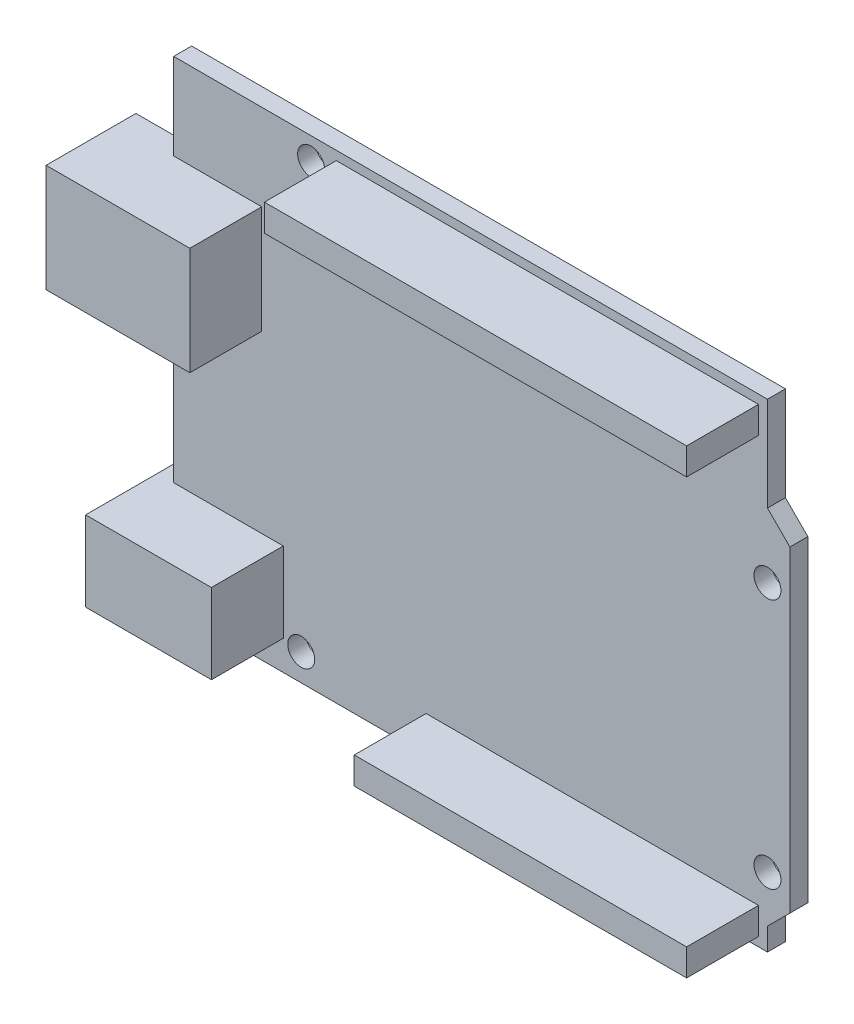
from build123d import *

# Parameters (mm, degrees)
CROQUIS1_R          = 1.5
CROQUIS1_W          = 37
CROQUIS1_H          = 3
CROQUIS1_W_2        = 47
BOSS_EXTRUDE1_DEPTH = 2
CROQUIS1_3_W        = 6.2
CROQUIS1_3_H        = 12
CROQUIS1_3_W_2      = 9.8
CROQUIS1_3_W_3      = 47
CROQUIS1_3_H_2      = 3
CROQUIS1_3_W_4      = 1.8
CROQUIS1_3_H_3      = 8.9
CROQUIS1_3_W_5      = 12.2
CROQUIS1_3_W_6      = 37
BOSS_EXTRUDE2_DEPTH = 10


with BuildPart() as part:
    # Croquis1 → Boss-Extrude1 (new body)
    with BuildSketch(Plane.XY):
        Polygon((31.8, 16.15), (31.8, 26.65), (-34.3, 26.65), (-34.3, 17.05), (-24.5, 17.05), (-24.5, 5.05), (-34.3, 5.05), (-34.3, -14.45), (-22.1, -14.45), (-22.1, -23.35), (-34.3, -23.35), (-34.3, -26.65), (31.8, -26.65), (31.8, -24.15), (34.3, -21.65), (34.3, 13.65), align=None)
        with Locations((-20.1, -23.65)):
            Circle(CROQUIS1_R, mode=Mode.SUBTRACT)
        with Locations((12.3, -24.15)):
            Rectangle(CROQUIS1_W, CROQUIS1_H, mode=Mode.SUBTRACT)
        with Locations((31.8, -18.95)):
            Circle(CROQUIS1_R, mode=Mode.SUBTRACT)
        with Locations((-19, 24.15)):
            Circle(CROQUIS1_R, mode=Mode.SUBTRACT)
        with Locations((31.8, 8.95)):
            Circle(CROQUIS1_R, mode=Mode.SUBTRACT)
        with Locations((7.3, 24.15)):
            Rectangle(CROQUIS1_W_2, CROQUIS1_H, mode=Mode.SUBTRACT)
    extrude(amount=BOSS_EXTRUDE1_DEPTH)

    # Croquis1_3 → Boss-Extrude2 (add)
    with BuildSketch(Plane.XY):
        with Locations((-37.4, 11.05)):
            Rectangle(CROQUIS1_3_W, CROQUIS1_3_H)
        with Locations((-29.4, 11.05)):
            Rectangle(CROQUIS1_3_W_2, CROQUIS1_3_H)
        with Locations((7.3, 24.15)):
            Rectangle(CROQUIS1_3_W_3, CROQUIS1_3_H_2)
        with Locations((-35.2, -18.9)):
            Rectangle(CROQUIS1_3_W_4, CROQUIS1_3_H_3)
        with Locations((-28.2, -18.9)):
            Rectangle(CROQUIS1_3_W_5, CROQUIS1_3_H_3)
        with Locations((12.3, -24.15)):
            Rectangle(CROQUIS1_3_W_6, CROQUIS1_3_H_2)
    extrude(amount=BOSS_EXTRUDE2_DEPTH)


solid = part.part
